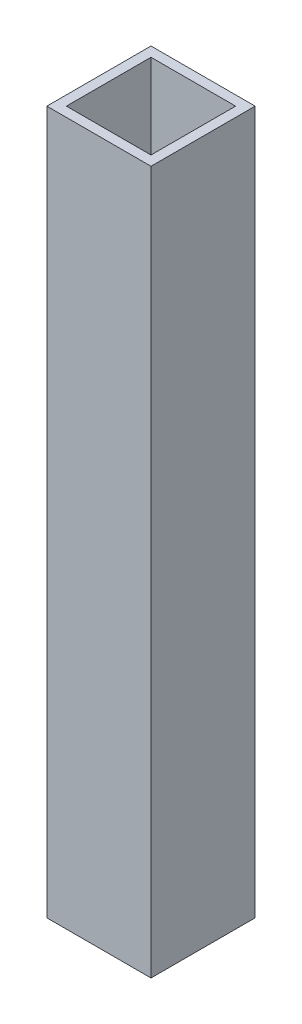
from build123d import *

# Parameters (mm, degrees)
SKETCH1_W           = 50.8
SKETCH1_H           = 50.8
SKETCH1_W_2         = 41.275
SKETCH1_H_2         = 41.275
BOSS_EXTRUDE1_DEPTH = 342.9


with BuildPart() as part:
    # Sketch1 → Boss-Extrude1 (new body)
    with BuildSketch(Plane(origin=(0, 171.45, 0), x_dir=(-1, 0, 0), z_dir=(0, 1, 0))):
        with Locations((0, 25.4)):
            Rectangle(SKETCH1_W, SKETCH1_H)
        with Locations((0, 25.4)):
            Rectangle(SKETCH1_W_2, SKETCH1_H_2, mode=Mode.SUBTRACT)
    extrude(amount=-BOSS_EXTRUDE1_DEPTH)


solid = part.part
